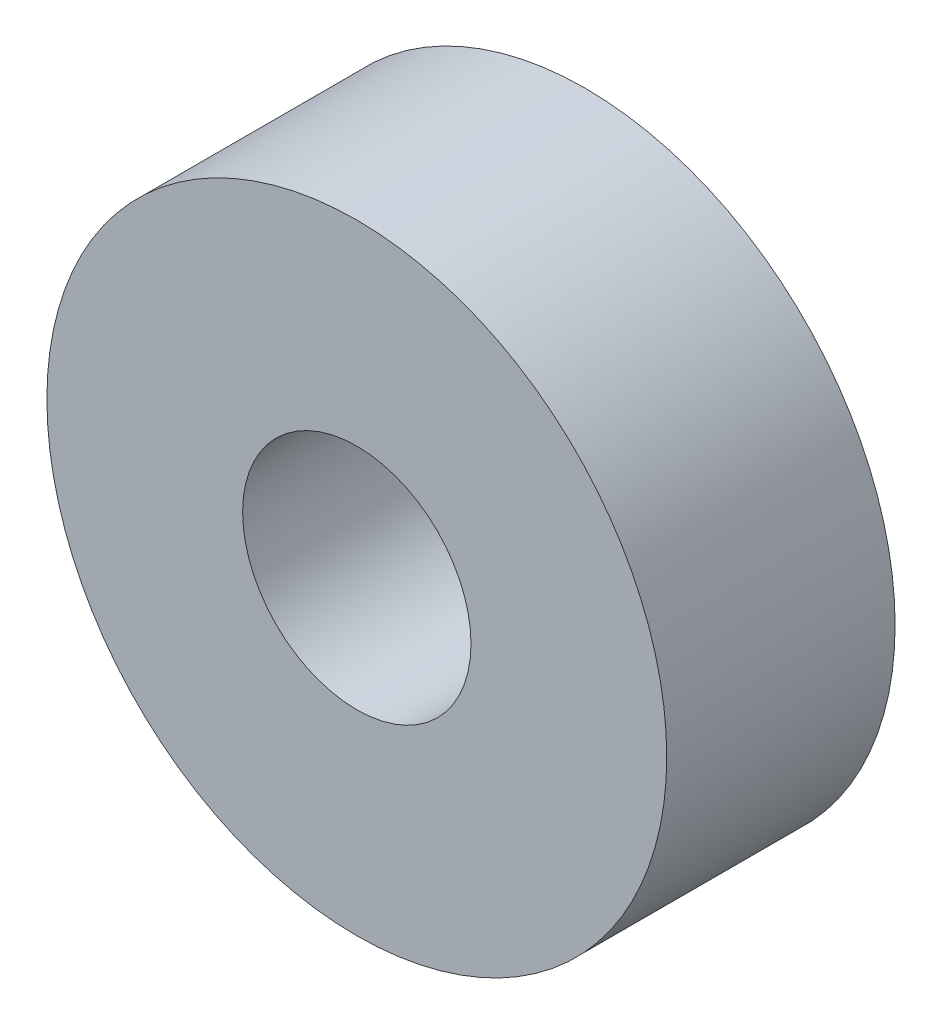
ISO-10303-21;
HEADER;
FILE_DESCRIPTION(('STEP AP214'),'2;1');
FILE_NAME('part.step','',(''),(''),'','','');
FILE_SCHEMA(('AUTOMOTIVE_DESIGN { 1 0 10303 214 1 1 1 1 }'));
ENDSEC;
DATA;
#1=APPLICATION_CONTEXT('core data for automotive mechanical design processes');
#2=APPLICATION_PROTOCOL_DEFINITION('international standard','automotive_design',2000,#1);
#3=PRODUCT_CONTEXT('',#1,'mechanical');
#4=PRODUCT('Part','Part','',(#3));
#5=PRODUCT_RELATED_PRODUCT_CATEGORY('part','',(#4));
#6=PRODUCT_DEFINITION_FORMATION('','',#4);
#7=PRODUCT_DEFINITION_CONTEXT('part definition',#1,'design');
#8=PRODUCT_DEFINITION('design','',#6,#7);
#9=PRODUCT_DEFINITION_SHAPE('','',#8);
#10=(LENGTH_UNIT() NAMED_UNIT(*) SI_UNIT(.MILLI.,.METRE.));
#11=(NAMED_UNIT(*) PLANE_ANGLE_UNIT() SI_UNIT($,.RADIAN.));
#12=(NAMED_UNIT(*) SI_UNIT($,.STERADIAN.) SOLID_ANGLE_UNIT());
#13=UNCERTAINTY_MEASURE_WITH_UNIT(LENGTH_MEASURE(1.E-05),#10,'distance_accuracy_value','');
#14=(GEOMETRIC_REPRESENTATION_CONTEXT(3) GLOBAL_UNCERTAINTY_ASSIGNED_CONTEXT((#13)) GLOBAL_UNIT_ASSIGNED_CONTEXT((#10,
#11,#12)) REPRESENTATION_CONTEXT('',''));
#15=CARTESIAN_POINT('',(0.,0.,0.));
#16=DIRECTION('',(0.,0.,1.));
#17=DIRECTION('',(1.,0.,0.));
#18=AXIS2_PLACEMENT_3D('',#15,#16,#17);
#19=CARTESIAN_POINT('',(0.,0.,3.5));
#20=DIRECTION('',(0.,0.,1.));
#21=DIRECTION('',(1.,0.,0.));
#22=AXIS2_PLACEMENT_3D('',#19,#20,#21);
#23=PLANE('',#22);
#24=CARTESIAN_POINT('',(0.,0.,3.5));
#25=DIRECTION('',(0.,0.,1.));
#26=DIRECTION('',(1.,0.,0.));
#27=AXIS2_PLACEMENT_3D('',#24,#25,#26);
#28=CIRCLE('',#27,4.75);
#29=CARTESIAN_POINT('',(4.75,0.,3.5));
#30=VERTEX_POINT('',#29);
#31=EDGE_CURVE('E10',#30,#30,#28,.T.);
#32=ORIENTED_EDGE('',*,*,#31,.T.);
#33=EDGE_LOOP('',(#32));
#34=FACE_BOUND('',#33,.T.);
#35=CARTESIAN_POINT('',(0.,0.,3.5));
#36=DIRECTION('',(0.,0.,1.));
#37=DIRECTION('',(1.,0.,0.));
#38=AXIS2_PLACEMENT_3D('',#35,#36,#37);
#39=CIRCLE('',#38,1.75);
#40=CARTESIAN_POINT('',(1.75,0.,3.5));
#41=VERTEX_POINT('',#40);
#42=EDGE_CURVE('E40',#41,#41,#39,.T.);
#43=ORIENTED_EDGE('',*,*,#42,.F.);
#44=EDGE_LOOP('',(#43));
#45=FACE_BOUND('',#44,.T.);
#46=ADVANCED_FACE('F29',(#34,#45),#23,.T.);
#47=CARTESIAN_POINT('',(0.,0.,0.));
#48=DIRECTION('',(0.,0.,1.));
#49=DIRECTION('',(1.,0.,0.));
#50=AXIS2_PLACEMENT_3D('',#47,#48,#49);
#51=PLANE('',#50);
#52=CARTESIAN_POINT('',(0.,0.,0.));
#53=DIRECTION('',(0.,0.,1.));
#54=DIRECTION('',(1.,0.,0.));
#55=AXIS2_PLACEMENT_3D('',#52,#53,#54);
#56=CIRCLE('',#55,4.75);
#57=CARTESIAN_POINT('',(4.75,0.,0.));
#58=VERTEX_POINT('',#57);
#59=EDGE_CURVE('E33',#58,#58,#56,.T.);
#60=ORIENTED_EDGE('',*,*,#59,.F.);
#61=EDGE_LOOP('',(#60));
#62=FACE_BOUND('',#61,.T.);
#63=CARTESIAN_POINT('',(0.,0.,0.));
#64=DIRECTION('',(0.,0.,1.));
#65=DIRECTION('',(1.,0.,0.));
#66=AXIS2_PLACEMENT_3D('',#63,#64,#65);
#67=CIRCLE('',#66,1.75);
#68=CARTESIAN_POINT('',(1.75,0.,0.));
#69=VERTEX_POINT('',#68);
#70=EDGE_CURVE('E42',#69,#69,#67,.T.);
#71=ORIENTED_EDGE('',*,*,#70,.T.);
#72=EDGE_LOOP('',(#71));
#73=FACE_BOUND('',#72,.T.);
#74=ADVANCED_FACE('F52',(#62,#73),#51,.F.);
#75=CARTESIAN_POINT('',(0.,0.,3.5));
#76=DIRECTION('',(0.,0.,-1.));
#77=DIRECTION('',(-1.,0.,0.));
#78=AXIS2_PLACEMENT_3D('',#75,#76,#77);
#79=CYLINDRICAL_SURFACE('',#78,4.75);
#80=ORIENTED_EDGE('',*,*,#31,.F.);
#81=EDGE_LOOP('',(#80));
#82=FACE_BOUND('',#81,.T.);
#83=ORIENTED_EDGE('',*,*,#59,.T.);
#84=EDGE_LOOP('',(#83));
#85=FACE_BOUND('',#84,.T.);
#86=ADVANCED_FACE('F31',(#82,#85),#79,.T.);
#87=CARTESIAN_POINT('',(0.,0.,3.5));
#88=DIRECTION('',(0.,0.,-1.));
#89=DIRECTION('',(-1.,0.,0.));
#90=AXIS2_PLACEMENT_3D('',#87,#88,#89);
#91=CYLINDRICAL_SURFACE('',#90,1.75);
#92=ORIENTED_EDGE('',*,*,#42,.T.);
#93=EDGE_LOOP('',(#92));
#94=FACE_BOUND('',#93,.T.);
#95=ORIENTED_EDGE('',*,*,#70,.F.);
#96=EDGE_LOOP('',(#95));
#97=FACE_BOUND('',#96,.T.);
#98=ADVANCED_FACE('F48',(#94,#97),#91,.F.);
#99=CLOSED_SHELL('',(#46,#74,#86,#98));
#100=MANIFOLD_SOLID_BREP('B2',#99);
#101=ADVANCED_BREP_SHAPE_REPRESENTATION('',(#18,#100),#14);
#102=SHAPE_DEFINITION_REPRESENTATION(#9,#101);
ENDSEC;
END-ISO-10303-21;
